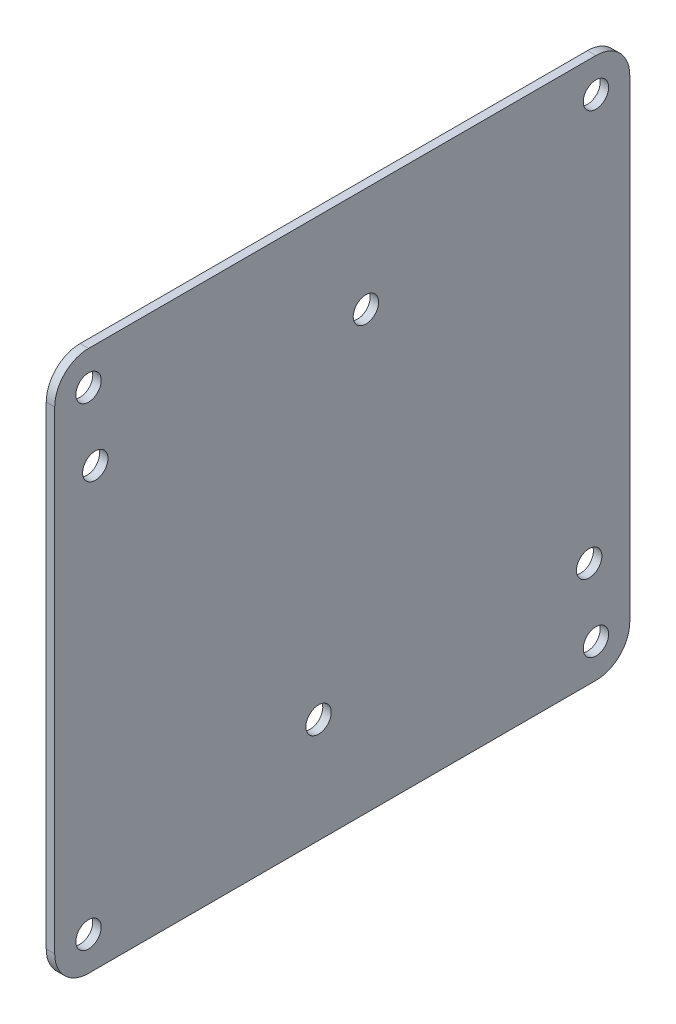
from build123d import *

# Parameters (mm, degrees)
SKETCH1_W           = 107.95
SKETCH1_H           = 101.6
SKETCH1_R           = 2.38125
BOSS_EXTRUDE1_DEPTH = 1.5875
FILLET1_R           = 6.35
SKETCH2_R           = 2.38125
CUT_EXTRUDE1_DEPTH  = 1.5875


with BuildPart() as part:
    # Sketch1 → Boss-Extrude1 (new body)
    with BuildSketch(Plane(origin=(0, 0, 0), x_dir=(0, 0, -1), z_dir=(1, 0, 0))):
        Rectangle(SKETCH1_W, SKETCH1_H)
        with Locations((-47.625, 44.45)):
            Circle(SKETCH1_R, mode=Mode.SUBTRACT)
        with Locations((47.625, 44.45)):
            Circle(SKETCH1_R, mode=Mode.SUBTRACT)
        with Locations((47.625, -44.45)):
            Circle(SKETCH1_R, mode=Mode.SUBTRACT)
        with Locations((-47.625, -44.45)):
            Circle(SKETCH1_R, mode=Mode.SUBTRACT)
    extrude(amount=BOSS_EXTRUDE1_DEPTH)

    # Fillet1
    fillet1_edges = [part.edges().sort_by_distance(p)[0] for p in [
        (0.79375, -50.8, -53.975),
        (0.79375, -50.8, 53.975),
        (0.79375, 50.8, 53.975),
        (0.79375, 50.8, -53.975),
    ]]
    fillet(fillet1_edges, radius=FILLET1_R)

    # Sketch2 → Cut-Extrude1 (cut)
    with BuildSketch(Plane(origin=(1.5875, 0, 0), x_dir=(0, 0, -1), z_dir=(1, 0, 0))):
        with Locations((-46.355, 31.115)):
            Circle(SKETCH2_R)
        with Locations((-4.445, -31.115)):
            Circle(SKETCH2_R)
        with Locations((4.445, 31.115)):
            Circle(SKETCH2_R)
        with Locations((46.355, -31.115)):
            Circle(SKETCH2_R)
    extrude(amount=-CUT_EXTRUDE1_DEPTH, mode=Mode.SUBTRACT)


solid = part.part
